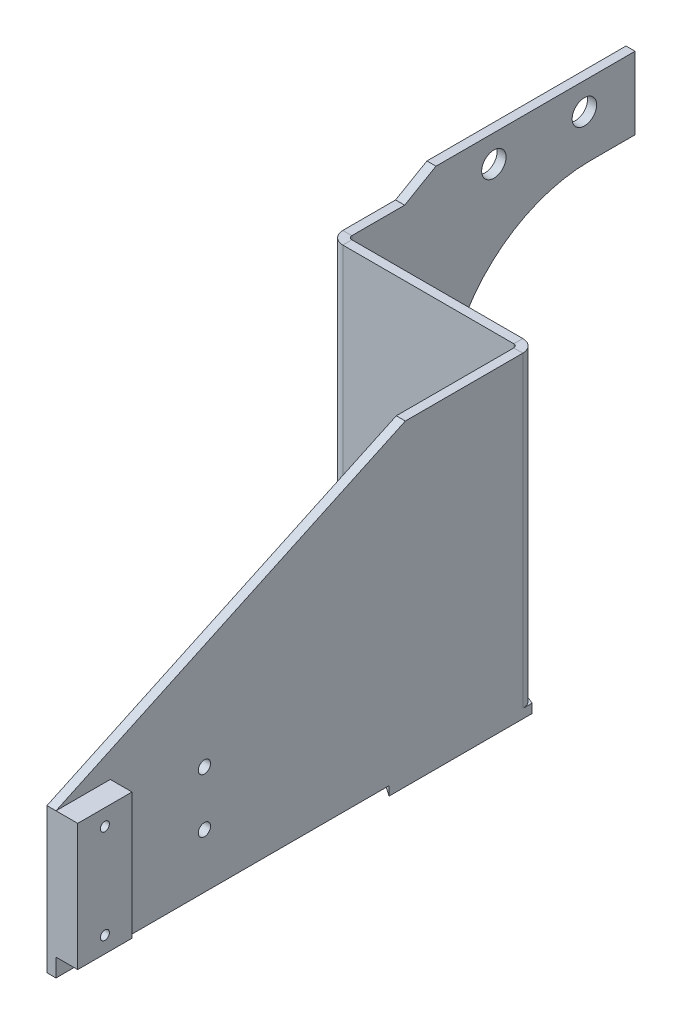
ISO-10303-21;
HEADER;
FILE_DESCRIPTION(('STEP AP214'),'2;1');
FILE_NAME('part.step','',(''),(''),'','','');
FILE_SCHEMA(('AUTOMOTIVE_DESIGN { 1 0 10303 214 1 1 1 1 }'));
ENDSEC;
DATA;
#1=APPLICATION_CONTEXT('core data for automotive mechanical design processes');
#2=APPLICATION_PROTOCOL_DEFINITION('international standard','automotive_design',2000,#1);
#3=PRODUCT_CONTEXT('',#1,'mechanical');
#4=PRODUCT('Part','Part','',(#3));
#5=PRODUCT_RELATED_PRODUCT_CATEGORY('part','',(#4));
#6=PRODUCT_DEFINITION_FORMATION('','',#4);
#7=PRODUCT_DEFINITION_CONTEXT('part definition',#1,'design');
#8=PRODUCT_DEFINITION('design','',#6,#7);
#9=PRODUCT_DEFINITION_SHAPE('','',#8);
#10=(LENGTH_UNIT() NAMED_UNIT(*) SI_UNIT(.MILLI.,.METRE.));
#11=(NAMED_UNIT(*) PLANE_ANGLE_UNIT() SI_UNIT($,.RADIAN.));
#12=(NAMED_UNIT(*) SI_UNIT($,.STERADIAN.) SOLID_ANGLE_UNIT());
#13=UNCERTAINTY_MEASURE_WITH_UNIT(LENGTH_MEASURE(1.E-05),#10,'distance_accuracy_value','');
#14=(GEOMETRIC_REPRESENTATION_CONTEXT(3) GLOBAL_UNCERTAINTY_ASSIGNED_CONTEXT((#13)) GLOBAL_UNIT_ASSIGNED_CONTEXT((#10,
#11,#12)) REPRESENTATION_CONTEXT('',''));
#15=CARTESIAN_POINT('',(0.,0.,0.));
#16=DIRECTION('',(0.,0.,1.));
#17=DIRECTION('',(1.,0.,0.));
#18=AXIS2_PLACEMENT_3D('',#15,#16,#17);
#19=CARTESIAN_POINT('',(-5.,-85.,523.));
#20=DIRECTION('',(0.,-1.,0.));
#21=DIRECTION('',(0.,0.,-1.));
#22=AXIS2_PLACEMENT_3D('',#19,#20,#21);
#23=PLANE('',#22);
#24=DIRECTION('',(0.,0.,-1.));
#25=VECTOR('',#24,1.);
#26=CARTESIAN_POINT('',(0.,-85.,523.));
#27=LINE('',#26,#25);
#28=CARTESIAN_POINT('',(0.,-85.,118.520131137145));
#29=VERTEX_POINT('',#28);
#30=CARTESIAN_POINT('',(0.,-85.,116.5));
#31=VERTEX_POINT('',#30);
#32=EDGE_CURVE('E407',#29,#31,#27,.T.);
#33=ORIENTED_EDGE('',*,*,#32,.F.);
#34=DIRECTION('',(0.927183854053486,0.,0.374606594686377));
#35=VECTOR('',#34,1.);
#36=CARTESIAN_POINT('',(-5.,-85.,116.5));
#37=LINE('',#36,#35);
#38=CARTESIAN_POINT('',(-5.,-85.,116.5));
#39=VERTEX_POINT('',#38);
#40=EDGE_CURVE('E229',#39,#29,#37,.T.);
#41=ORIENTED_EDGE('',*,*,#40,.F.);
#42=DIRECTION('',(1.,0.,0.));
#43=VECTOR('',#42,1.);
#44=CARTESIAN_POINT('',(-5.,-85.,116.5));
#45=LINE('',#44,#43);
#46=EDGE_CURVE('E395',#39,#31,#45,.T.);
#47=ORIENTED_EDGE('',*,*,#46,.T.);
#48=EDGE_LOOP('',(#33,#41,#47));
#49=FACE_BOUND('',#48,.T.);
#50=ADVANCED_FACE('F16',(#49),#23,.T.);
#51=CARTESIAN_POINT('',(98.4657082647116,-85.,423.397124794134));
#52=DIRECTION('',(0.,-1.,0.));
#53=DIRECTION('',(0.,0.,-1.));
#54=AXIS2_PLACEMENT_3D('',#51,#52,#53);
#55=PLANE('',#54);
#56=DIRECTION('',(0.,0.,-1.));
#57=VECTOR('',#56,1.);
#58=CARTESIAN_POINT('',(98.4657082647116,-85.,423.397124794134));
#59=LINE('',#58,#57);
#60=CARTESIAN_POINT('',(98.4657082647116,-85.,423.397124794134));
#61=VERTEX_POINT('',#60);
#62=CARTESIAN_POINT('',(98.4657082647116,-85.,235.91317736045));
#63=VERTEX_POINT('',#62);
#64=EDGE_CURVE('E340',#61,#63,#59,.T.);
#65=ORIENTED_EDGE('',*,*,#64,.T.);
#66=DIRECTION('',(-0.819152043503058,0.,-0.573576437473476));
#67=VECTOR('',#66,1.);
#68=CARTESIAN_POINT('',(103.465708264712,-85.,239.414215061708));
#69=LINE('',#68,#67);
#70=CARTESIAN_POINT('',(103.465708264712,-85.,239.414215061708));
#71=VERTEX_POINT('',#70);
#72=EDGE_CURVE('E549',#71,#63,#69,.T.);
#73=ORIENTED_EDGE('',*,*,#72,.F.);
#74=DIRECTION('',(0.,0.,-1.));
#75=VECTOR('',#74,1.);
#76=CARTESIAN_POINT('',(103.465708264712,-85.,423.397124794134));
#77=LINE('',#76,#75);
#78=CARTESIAN_POINT('',(103.465708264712,-85.,423.397124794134));
#79=VERTEX_POINT('',#78);
#80=EDGE_CURVE('E235',#79,#71,#77,.T.);
#81=ORIENTED_EDGE('',*,*,#80,.F.);
#82=DIRECTION('',(1.,0.,0.));
#83=VECTOR('',#82,1.);
#84=CARTESIAN_POINT('',(98.4657082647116,-85.,423.397124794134));
#85=LINE('',#84,#83);
#86=EDGE_CURVE('E352',#61,#79,#85,.T.);
#87=ORIENTED_EDGE('',*,*,#86,.F.);
#88=EDGE_LOOP('',(#65,#73,#81,#87));
#89=FACE_BOUND('',#88,.T.);
#90=ADVANCED_FACE('F596',(#89),#55,.T.);
#91=CARTESIAN_POINT('',(103.465708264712,-85.,423.397124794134));
#92=DIRECTION('',(1.,0.,0.));
#93=DIRECTION('',(0.,0.,-1.));
#94=AXIS2_PLACEMENT_3D('',#91,#92,#93);
#95=PLANE('',#94);
#96=CARTESIAN_POINT('',(103.465708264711,-25.,341.397124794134));
#97=DIRECTION('',(1.,0.,0.));
#98=DIRECTION('',(0.,0.,-1.));
#99=AXIS2_PLACEMENT_3D('',#96,#97,#98);
#100=CIRCLE('',#99,3.4);
#101=CARTESIAN_POINT('',(103.465708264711,-25.,337.997124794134));
#102=VERTEX_POINT('',#101);
#103=EDGE_CURVE('E297',#102,#102,#100,.T.);
#104=ORIENTED_EDGE('',*,*,#103,.F.);
#105=EDGE_LOOP('',(#104));
#106=FACE_BOUND('',#105,.T.);
#107=CARTESIAN_POINT('',(103.465708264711,-55.,341.397124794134));
#108=DIRECTION('',(1.,0.,0.));
#109=DIRECTION('',(0.,0.,-1.));
#110=AXIS2_PLACEMENT_3D('',#107,#108,#109);
#111=CIRCLE('',#110,3.4);
#112=CARTESIAN_POINT('',(103.465708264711,-55.,337.997124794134));
#113=VERTEX_POINT('',#112);
#114=EDGE_CURVE('E289',#113,#113,#111,.T.);
#115=ORIENTED_EDGE('',*,*,#114,.F.);
#116=EDGE_LOOP('',(#115));
#117=FACE_BOUND('',#116,.T.);
#118=DIRECTION('',(0.,1.,0.));
#119=VECTOR('',#118,1.);
#120=CARTESIAN_POINT('',(103.465708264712,-5.,393.397124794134));
#121=LINE('',#120,#119);
#122=CARTESIAN_POINT('',(103.465708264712,-75.,393.397124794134));
#123=VERTEX_POINT('',#122);
#124=CARTESIAN_POINT('',(103.465708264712,-5.,393.397124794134));
#125=VERTEX_POINT('',#124);
#126=EDGE_CURVE('E268',#123,#125,#121,.T.);
#127=ORIENTED_EDGE('',*,*,#126,.F.);
#128=DIRECTION('',(0.,0.,-1.));
#129=VECTOR('',#128,1.);
#130=CARTESIAN_POINT('',(103.465708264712,-75.,423.397124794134));
#131=LINE('',#130,#129);
#132=CARTESIAN_POINT('',(103.465708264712,-75.,423.397124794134));
#133=VERTEX_POINT('',#132);
#134=EDGE_CURVE('E251',#133,#123,#131,.T.);
#135=ORIENTED_EDGE('',*,*,#134,.F.);
#136=DIRECTION('',(0.,-1.,0.));
#137=VECTOR('',#136,1.);
#138=CARTESIAN_POINT('',(103.465708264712,95.,423.397124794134));
#139=LINE('',#138,#137);
#140=EDGE_CURVE('E331',#133,#79,#139,.T.);
#141=ORIENTED_EDGE('',*,*,#140,.T.);
#142=ORIENTED_EDGE('',*,*,#80,.T.);
#143=DIRECTION('',(0.,1.,0.));
#144=VECTOR('',#143,1.);
#145=CARTESIAN_POINT('',(103.465708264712,-90.,239.414215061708));
#146=LINE('',#145,#144);
#147=CARTESIAN_POINT('',(103.465708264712,-90.,239.414215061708));
#148=VERTEX_POINT('',#147);
#149=EDGE_CURVE('E37',#148,#71,#146,.T.);
#150=ORIENTED_EDGE('',*,*,#149,.F.);
#151=DIRECTION('',(0.,0.,1.));
#152=VECTOR('',#151,1.);
#153=CARTESIAN_POINT('',(103.465708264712,-90.,239.414215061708));
#154=LINE('',#153,#152);
#155=CARTESIAN_POINT('',(103.465708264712,-90.,160.322990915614));
#156=VERTEX_POINT('',#155);
#157=EDGE_CURVE('E219',#156,#148,#154,.T.);
#158=ORIENTED_EDGE('',*,*,#157,.F.);
#159=DIRECTION('',(0.,1.,0.));
#160=VECTOR('',#159,1.);
#161=CARTESIAN_POINT('',(103.465708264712,-90.,160.322990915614));
#162=LINE('',#161,#160);
#163=CARTESIAN_POINT('',(103.465708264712,-85.,160.322990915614));
#164=VERTEX_POINT('',#163);
#165=EDGE_CURVE('E536',#156,#164,#162,.T.);
#166=ORIENTED_EDGE('',*,*,#165,.T.);
#167=DIRECTION('',(0.,0.,1.));
#168=VECTOR('',#167,1.);
#169=CARTESIAN_POINT('',(103.465708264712,-85.,239.414215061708));
#170=LINE('',#169,#168);
#171=CARTESIAN_POINT('',(103.465708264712,-85.,165.465708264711));
#172=VERTEX_POINT('',#171);
#173=EDGE_CURVE('E544',#164,#172,#170,.T.);
#174=ORIENTED_EDGE('',*,*,#173,.T.);
#175=DIRECTION('',(0.,1.,0.));
#176=VECTOR('',#175,1.);
#177=CARTESIAN_POINT('',(103.465708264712,-85.,165.465708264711));
#178=LINE('',#177,#176);
#179=CARTESIAN_POINT('',(103.465708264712,85.,165.465708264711));
#180=VERTEX_POINT('',#179);
#181=EDGE_CURVE('E334',#172,#180,#178,.T.);
#182=ORIENTED_EDGE('',*,*,#181,.T.);
#183=DIRECTION('',(0.,0.,-1.));
#184=VECTOR('',#183,1.);
#185=CARTESIAN_POINT('',(103.465708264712,85.,27.7176328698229));
#186=LINE('',#185,#184);
#187=CARTESIAN_POINT('',(103.465708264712,85.,230.391501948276));
#188=VERTEX_POINT('',#187);
#189=EDGE_CURVE('E324',#188,#180,#186,.T.);
#190=ORIENTED_EDGE('',*,*,#189,.F.);
#191=DIRECTION('',(0.,0.422618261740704,-0.906307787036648));
#192=VECTOR('',#191,1.);
#193=CARTESIAN_POINT('',(103.465708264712,85.,230.391501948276));
#194=LINE('',#193,#192);
#195=CARTESIAN_POINT('',(103.465708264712,-5.,423.397124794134));
#196=VERTEX_POINT('',#195);
#197=EDGE_CURVE('E362',#196,#188,#194,.T.);
#198=ORIENTED_EDGE('',*,*,#197,.F.);
#199=DIRECTION('',(0.,0.,1.));
#200=VECTOR('',#199,1.);
#201=CARTESIAN_POINT('',(103.465708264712,-5.,423.397124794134));
#202=LINE('',#201,#200);
#203=EDGE_CURVE('E257',#125,#196,#202,.T.);
#204=ORIENTED_EDGE('',*,*,#203,.F.);
#205=EDGE_LOOP('',(#127,#135,#141,#142,#150,#158,#166,#174,#182,#190,#198,#204));
#206=FACE_BOUND('',#205,.T.);
#207=ADVANCED_FACE('F233',(#106,#117,#206),#95,.T.);
#208=CARTESIAN_POINT('',(-34.2137836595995,85.,163.465708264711));
#209=DIRECTION('',(0.,-1.,0.));
#210=DIRECTION('',(-1.,0.,0.));
#211=AXIS2_PLACEMENT_3D('',#208,#209,#210);
#212=PLANE('',#211);
#213=DIRECTION('',(-1.,0.,0.));
#214=VECTOR('',#213,1.);
#215=CARTESIAN_POINT('',(-34.2137836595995,85.,163.465708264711));
#216=LINE('',#215,#214);
#217=CARTESIAN_POINT('',(96.4657082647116,85.,163.465708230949));
#218=VERTEX_POINT('',#217);
#219=CARTESIAN_POINT('',(2.00000000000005,85.,163.465708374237));
#220=VERTEX_POINT('',#219);
#221=EDGE_CURVE('E20',#218,#220,#216,.T.);
#222=ORIENTED_EDGE('',*,*,#221,.F.);
#223=DIRECTION('',(0.,0.,-1.));
#224=VECTOR('',#223,1.);
#225=CARTESIAN_POINT('',(96.4657082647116,85.,163.465708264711));
#226=LINE('',#225,#224);
#227=CARTESIAN_POINT('',(96.4657082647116,85.,158.465708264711));
#228=VERTEX_POINT('',#227);
#229=EDGE_CURVE('E11',#218,#228,#226,.T.);
#230=ORIENTED_EDGE('',*,*,#229,.T.);
#231=DIRECTION('',(-1.,0.,0.));
#232=VECTOR('',#231,1.);
#233=CARTESIAN_POINT('',(-34.2137836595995,85.,158.465708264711));
#234=LINE('',#233,#232);
#235=CARTESIAN_POINT('',(2.,85.,158.465708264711));
#236=VERTEX_POINT('',#235);
#237=EDGE_CURVE('E398',#228,#236,#234,.T.);
#238=ORIENTED_EDGE('',*,*,#237,.T.);
#239=DIRECTION('',(0.,0.,-1.));
#240=VECTOR('',#239,1.);
#241=CARTESIAN_POINT('',(2.00000000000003,85.,163.465708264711));
#242=LINE('',#241,#240);
#243=EDGE_CURVE('E465',#220,#236,#242,.T.);
#244=ORIENTED_EDGE('',*,*,#243,.F.);
#245=EDGE_LOOP('',(#222,#230,#238,#244));
#246=FACE_BOUND('',#245,.T.);
#247=ADVANCED_FACE('F18',(#246),#212,.F.);
#248=CARTESIAN_POINT('',(361.465708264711,-85.,163.46570826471));
#249=DIRECTION('',(0.,0.,-1.));
#250=DIRECTION('',(-1.,0.,0.));
#251=AXIS2_PLACEMENT_3D('',#248,#249,#250);
#252=PLANE('',#251);
#253=DIRECTION('',(-1.,0.,0.));
#254=VECTOR('',#253,1.);
#255=CARTESIAN_POINT('',(361.465708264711,-85.,163.46570826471));
#256=LINE('',#255,#254);
#257=CARTESIAN_POINT('',(96.4657082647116,-85.,163.465708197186));
#258=VERTEX_POINT('',#257);
#259=CARTESIAN_POINT('',(2.,-85.,163.465708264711));
#260=VERTEX_POINT('',#259);
#261=EDGE_CURVE('E466',#258,#260,#256,.T.);
#262=ORIENTED_EDGE('',*,*,#261,.F.);
#263=DIRECTION('',(0.,1.,0.));
#264=VECTOR('',#263,1.);
#265=CARTESIAN_POINT('',(96.4657082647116,-85.,163.465708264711));
#266=LINE('',#265,#264);
#267=EDGE_CURVE('E472',#258,#218,#266,.T.);
#268=ORIENTED_EDGE('',*,*,#267,.T.);
#269=ORIENTED_EDGE('',*,*,#221,.T.);
#270=DIRECTION('',(0.,1.,0.));
#271=VECTOR('',#270,1.);
#272=CARTESIAN_POINT('',(2.00000000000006,-85.,163.465708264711));
#273=LINE('',#272,#271);
#274=EDGE_CURVE('E462',#260,#220,#273,.T.);
#275=ORIENTED_EDGE('',*,*,#274,.F.);
#276=EDGE_LOOP('',(#262,#268,#269,#275));
#277=FACE_BOUND('',#276,.T.);
#278=ADVANCED_FACE('F491',(#277),#252,.F.);
#279=CARTESIAN_POINT('',(361.465708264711,-85.,158.46570826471));
#280=DIRECTION('',(0.,0.,-1.));
#281=DIRECTION('',(-1.,0.,0.));
#282=AXIS2_PLACEMENT_3D('',#279,#280,#281);
#283=PLANE('',#282);
#284=DIRECTION('',(0.,1.,0.));
#285=VECTOR('',#284,1.);
#286=CARTESIAN_POINT('',(96.4657082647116,-85.,158.465708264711));
#287=LINE('',#286,#285);
#288=CARTESIAN_POINT('',(96.4657082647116,-85.,158.465708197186));
#289=VERTEX_POINT('',#288);
#290=EDGE_CURVE('E25',#289,#228,#287,.T.);
#291=ORIENTED_EDGE('',*,*,#290,.F.);
#292=DIRECTION('',(-1.,0.,0.));
#293=VECTOR('',#292,1.);
#294=CARTESIAN_POINT('',(361.465708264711,-85.,158.46570826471));
#295=LINE('',#294,#293);
#296=CARTESIAN_POINT('',(2.,-85.,158.465708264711));
#297=VERTEX_POINT('',#296);
#298=EDGE_CURVE('E479',#289,#297,#295,.T.);
#299=ORIENTED_EDGE('',*,*,#298,.T.);
#300=DIRECTION('',(0.,1.,0.));
#301=VECTOR('',#300,1.);
#302=CARTESIAN_POINT('',(2.00000000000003,-85.,158.465708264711));
#303=LINE('',#302,#301);
#304=EDGE_CURVE('E469',#297,#236,#303,.T.);
#305=ORIENTED_EDGE('',*,*,#304,.T.);
#306=ORIENTED_EDGE('',*,*,#237,.F.);
#307=EDGE_LOOP('',(#291,#299,#305,#306));
#308=FACE_BOUND('',#307,.T.);
#309=ADVANCED_FACE('F567',(#308),#283,.T.);
#310=CARTESIAN_POINT('',(-5.,-11.1081457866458,103.470872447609));
#311=DIRECTION('',(0.,0.173648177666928,0.984807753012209));
#312=DIRECTION('',(0.,-0.984807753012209,0.173648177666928));
#313=AXIS2_PLACEMENT_3D('',#310,#311,#312);
#314=PLANE('',#313);
#315=DIRECTION('',(0.,-0.984807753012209,0.173648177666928));
#316=VECTOR('',#315,1.);
#317=CARTESIAN_POINT('',(0.,-11.1081457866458,103.470872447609));
#318=LINE('',#317,#316);
#319=CARTESIAN_POINT('',(0.,-11.1081457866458,103.470872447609));
#320=VERTEX_POINT('',#319);
#321=EDGE_CURVE('E458',#320,#31,#318,.T.);
#322=ORIENTED_EDGE('',*,*,#321,.T.);
#323=ORIENTED_EDGE('',*,*,#46,.F.);
#324=DIRECTION('',(0.,-0.984807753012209,0.173648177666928));
#325=VECTOR('',#324,1.);
#326=CARTESIAN_POINT('',(-5.,-11.1081457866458,103.470872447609));
#327=LINE('',#326,#325);
#328=CARTESIAN_POINT('',(-5.,-11.1081457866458,103.470872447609));
#329=VERTEX_POINT('',#328);
#330=EDGE_CURVE('E413',#329,#39,#327,.T.);
#331=ORIENTED_EDGE('',*,*,#330,.F.);
#332=DIRECTION('',(1.,0.,0.));
#333=VECTOR('',#332,1.);
#334=CARTESIAN_POINT('',(-5.,-11.1081457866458,103.470872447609));
#335=LINE('',#334,#333);
#336=EDGE_CURVE('E456',#329,#320,#335,.T.);
#337=ORIENTED_EDGE('',*,*,#336,.T.);
#338=EDGE_LOOP('',(#322,#323,#331,#337));
#339=FACE_BOUND('',#338,.T.);
#340=ADVANCED_FACE('F531',(#339),#314,.F.);
#341=CARTESIAN_POINT('',(-5.,-25.,24.6862522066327));
#342=DIRECTION('',(1.,0.,0.));
#343=DIRECTION('',(0.,0.,-1.));
#344=AXIS2_PLACEMENT_3D('',#341,#342,#343);
#345=CYLINDRICAL_SURFACE('',#344,80.);
#346=CARTESIAN_POINT('',(0.,-25.,24.6862522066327));
#347=DIRECTION('',(1.,0.,0.));
#348=DIRECTION('',(0.,0.,1.));
#349=AXIS2_PLACEMENT_3D('',#346,#347,#348);
#350=CIRCLE('',#349,80.);
#351=CARTESIAN_POINT('',(0.,55.,24.6862522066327));
#352=VERTEX_POINT('',#351);
#353=EDGE_CURVE('E453',#352,#320,#350,.T.);
#354=ORIENTED_EDGE('',*,*,#353,.T.);
#355=ORIENTED_EDGE('',*,*,#336,.F.);
#356=CARTESIAN_POINT('',(-5.,-25.,24.6862522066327));
#357=DIRECTION('',(1.,0.,0.));
#358=DIRECTION('',(0.,0.,1.));
#359=AXIS2_PLACEMENT_3D('',#356,#357,#358);
#360=CIRCLE('',#359,80.);
#361=CARTESIAN_POINT('',(-5.,55.,24.6862522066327));
#362=VERTEX_POINT('',#361);
#363=EDGE_CURVE('E416',#362,#329,#360,.T.);
#364=ORIENTED_EDGE('',*,*,#363,.F.);
#365=DIRECTION('',(1.,0.,0.));
#366=VECTOR('',#365,1.);
#367=CARTESIAN_POINT('',(-5.,55.,24.6862522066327));
#368=LINE('',#367,#366);
#369=EDGE_CURVE('E451',#362,#352,#368,.T.);
#370=ORIENTED_EDGE('',*,*,#369,.T.);
#371=EDGE_LOOP('',(#354,#355,#364,#370));
#372=FACE_BOUND('',#371,.T.);
#373=ADVANCED_FACE('F526',(#372),#345,.F.);
#374=CARTESIAN_POINT('',(-5.,55.,0.));
#375=DIRECTION('',(0.,1.,0.));
#376=DIRECTION('',(0.,0.,1.));
#377=AXIS2_PLACEMENT_3D('',#374,#375,#376);
#378=PLANE('',#377);
#379=DIRECTION('',(0.,0.,1.));
#380=VECTOR('',#379,1.);
#381=CARTESIAN_POINT('',(0.,55.,0.));
#382=LINE('',#381,#380);
#383=CARTESIAN_POINT('',(0.,55.,0.));
#384=VERTEX_POINT('',#383);
#385=EDGE_CURVE('E448',#384,#352,#382,.T.);
#386=ORIENTED_EDGE('',*,*,#385,.T.);
#387=ORIENTED_EDGE('',*,*,#369,.F.);
#388=DIRECTION('',(0.,0.,1.));
#389=VECTOR('',#388,1.);
#390=CARTESIAN_POINT('',(-5.,55.,0.));
#391=LINE('',#390,#389);
#392=CARTESIAN_POINT('',(-5.,55.,0.));
#393=VERTEX_POINT('',#392);
#394=EDGE_CURVE('E419',#393,#362,#391,.T.);
#395=ORIENTED_EDGE('',*,*,#394,.F.);
#396=DIRECTION('',(1.,0.,0.));
#397=VECTOR('',#396,1.);
#398=CARTESIAN_POINT('',(-5.,55.,0.));
#399=LINE('',#398,#397);
#400=EDGE_CURVE('E446',#393,#384,#399,.T.);
#401=ORIENTED_EDGE('',*,*,#400,.T.);
#402=EDGE_LOOP('',(#386,#387,#395,#401));
#403=FACE_BOUND('',#402,.T.);
#404=ADVANCED_FACE('F522',(#403),#378,.F.);
#405=CARTESIAN_POINT('',(-5.,95.,0.));
#406=DIRECTION('',(0.,0.,-1.));
#407=DIRECTION('',(0.,1.,0.));
#408=AXIS2_PLACEMENT_3D('',#405,#406,#407);
#409=PLANE('',#408);
#410=ORIENTED_EDGE('',*,*,#400,.F.);
#411=DIRECTION('',(0.,1.,0.));
#412=VECTOR('',#411,1.);
#413=CARTESIAN_POINT('',(-5.,95.,0.));
#414=LINE('',#413,#412);
#415=CARTESIAN_POINT('',(-5.,95.,0.));
#416=VERTEX_POINT('',#415);
#417=EDGE_CURVE('E444',#393,#416,#414,.T.);
#418=ORIENTED_EDGE('',*,*,#417,.T.);
#419=DIRECTION('',(1.,0.,0.));
#420=VECTOR('',#419,1.);
#421=CARTESIAN_POINT('',(-5.,95.,0.));
#422=LINE('',#421,#420);
#423=CARTESIAN_POINT('',(0.,95.,0.));
#424=VERTEX_POINT('',#423);
#425=EDGE_CURVE('E441',#416,#424,#422,.T.);
#426=ORIENTED_EDGE('',*,*,#425,.T.);
#427=DIRECTION('',(0.,1.,0.));
#428=VECTOR('',#427,1.);
#429=CARTESIAN_POINT('',(0.,95.,0.));
#430=LINE('',#429,#428);
#431=EDGE_CURVE('E402',#384,#424,#430,.T.);
#432=ORIENTED_EDGE('',*,*,#431,.F.);
#433=EDGE_LOOP('',(#410,#418,#426,#432));
#434=FACE_BOUND('',#433,.T.);
#435=ADVANCED_FACE('F519',(#434),#409,.T.);
#436=CARTESIAN_POINT('',(-5.,95.,523.));
#437=DIRECTION('',(0.,1.,0.));
#438=DIRECTION('',(0.,0.,1.));
#439=AXIS2_PLACEMENT_3D('',#436,#437,#438);
#440=PLANE('',#439);
#441=DIRECTION('',(1.,0.,0.));
#442=VECTOR('',#441,1.);
#443=CARTESIAN_POINT('',(-5.,95.,110.));
#444=LINE('',#443,#442);
#445=CARTESIAN_POINT('',(-5.,95.,110.));
#446=VERTEX_POINT('',#445);
#447=CARTESIAN_POINT('',(0.,95.,110.));
#448=VERTEX_POINT('',#447);
#449=EDGE_CURVE('E438',#446,#448,#444,.T.);
#450=ORIENTED_EDGE('',*,*,#449,.T.);
#451=DIRECTION('',(0.,0.,1.));
#452=VECTOR('',#451,1.);
#453=CARTESIAN_POINT('',(0.,95.,523.));
#454=LINE('',#453,#452);
#455=EDGE_CURVE('E399',#424,#448,#454,.T.);
#456=ORIENTED_EDGE('',*,*,#455,.F.);
#457=ORIENTED_EDGE('',*,*,#425,.F.);
#458=DIRECTION('',(0.,0.,1.));
#459=VECTOR('',#458,1.);
#460=CARTESIAN_POINT('',(-5.,95.,523.));
#461=LINE('',#460,#459);
#462=EDGE_CURVE('E435',#416,#446,#461,.T.);
#463=ORIENTED_EDGE('',*,*,#462,.T.);
#464=EDGE_LOOP('',(#450,#456,#457,#463));
#465=FACE_BOUND('',#464,.T.);
#466=ADVANCED_FACE('F514',(#465),#440,.T.);
#467=CARTESIAN_POINT('',(-5.,95.,110.));
#468=DIRECTION('',(0.,-0.866025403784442,-0.5));
#469=DIRECTION('',(0.,0.5,-0.866025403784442));
#470=AXIS2_PLACEMENT_3D('',#467,#468,#469);
#471=PLANE('',#470);
#472=DIRECTION('',(0.,0.5,-0.866025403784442));
#473=VECTOR('',#472,1.);
#474=CARTESIAN_POINT('',(0.,95.,110.));
#475=LINE('',#474,#473);
#476=CARTESIAN_POINT('',(0.,85.,127.320508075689));
#477=VERTEX_POINT('',#476);
#478=EDGE_CURVE('E433',#477,#448,#475,.T.);
#479=ORIENTED_EDGE('',*,*,#478,.T.);
#480=ORIENTED_EDGE('',*,*,#449,.F.);
#481=DIRECTION('',(0.,0.5,-0.866025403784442));
#482=VECTOR('',#481,1.);
#483=CARTESIAN_POINT('',(-5.,95.,110.));
#484=LINE('',#483,#482);
#485=CARTESIAN_POINT('',(-5.,85.,127.320508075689));
#486=VERTEX_POINT('',#485);
#487=EDGE_CURVE('E422',#486,#446,#484,.T.);
#488=ORIENTED_EDGE('',*,*,#487,.F.);
#489=DIRECTION('',(1.,0.,0.));
#490=VECTOR('',#489,1.);
#491=CARTESIAN_POINT('',(-5.,85.,127.320508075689));
#492=LINE('',#491,#490);
#493=EDGE_CURVE('E430',#486,#477,#492,.T.);
#494=ORIENTED_EDGE('',*,*,#493,.T.);
#495=EDGE_LOOP('',(#479,#480,#488,#494));
#496=FACE_BOUND('',#495,.T.);
#497=ADVANCED_FACE('F509',(#496),#471,.F.);
#498=CARTESIAN_POINT('',(-5.,-85.,523.));
#499=DIRECTION('',(1.,0.,0.));
#500=DIRECTION('',(0.,0.,-1.));
#501=AXIS2_PLACEMENT_3D('',#498,#499,#500);
#502=PLANE('',#501);
#503=CARTESIAN_POINT('',(-5.00000005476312,80.,28.));
#504=DIRECTION('',(1.,0.,0.));
#505=DIRECTION('',(0.,0.,-1.));
#506=AXIS2_PLACEMENT_3D('',#503,#504,#505);
#507=CIRCLE('',#506,6.75);
#508=CARTESIAN_POINT('',(-5.00000005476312,80.,21.25));
#509=VERTEX_POINT('',#508);
#510=EDGE_CURVE('E305',#509,#509,#507,.T.);
#511=ORIENTED_EDGE('',*,*,#510,.T.);
#512=EDGE_LOOP('',(#511));
#513=FACE_BOUND('',#512,.T.);
#514=CARTESIAN_POINT('',(-5.00000005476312,80.,78.));
#515=DIRECTION('',(1.,0.,0.));
#516=DIRECTION('',(0.,0.,-1.));
#517=AXIS2_PLACEMENT_3D('',#514,#515,#516);
#518=CIRCLE('',#517,6.75);
#519=CARTESIAN_POINT('',(-5.00000005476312,80.,71.25));
#520=VERTEX_POINT('',#519);
#521=EDGE_CURVE('E311',#520,#520,#518,.T.);
#522=ORIENTED_EDGE('',*,*,#521,.T.);
#523=EDGE_LOOP('',(#522));
#524=FACE_BOUND('',#523,.T.);
#525=CARTESIAN_POINT('',(-5.00000005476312,-60.,128.));
#526=DIRECTION('',(1.,0.,0.));
#527=DIRECTION('',(0.,0.,-1.));
#528=AXIS2_PLACEMENT_3D('',#525,#526,#527);
#529=CIRCLE('',#528,6.75);
#530=CARTESIAN_POINT('',(-5.00000005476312,-60.,121.25));
#531=VERTEX_POINT('',#530);
#532=EDGE_CURVE('E317',#531,#531,#529,.T.);
#533=ORIENTED_EDGE('',*,*,#532,.T.);
#534=EDGE_LOOP('',(#533));
#535=FACE_BOUND('',#534,.T.);
#536=ORIENTED_EDGE('',*,*,#330,.T.);
#537=DIRECTION('',(0.,1.,0.));
#538=VECTOR('',#537,1.);
#539=CARTESIAN_POINT('',(-5.,-90.,116.5));
#540=LINE('',#539,#538);
#541=CARTESIAN_POINT('',(-5.,-90.,116.5));
#542=VERTEX_POINT('',#541);
#543=EDGE_CURVE('E244',#542,#39,#540,.T.);
#544=ORIENTED_EDGE('',*,*,#543,.F.);
#545=DIRECTION('',(1.37023613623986E-09,0.,-1.));
#546=VECTOR('',#545,1.);
#547=CARTESIAN_POINT('',(-5.00000006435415,-90.,163.465708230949));
#548=LINE('',#547,#546);
#549=CARTESIAN_POINT('',(-5.00000006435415,-90.,163.465708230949));
#550=VERTEX_POINT('',#549);
#551=EDGE_CURVE('E218',#550,#542,#548,.T.);
#552=ORIENTED_EDGE('',*,*,#551,.F.);
#553=DIRECTION('',(0.,1.,0.));
#554=VECTOR('',#553,1.);
#555=CARTESIAN_POINT('',(-5.00000006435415,-90.,163.465708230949));
#556=LINE('',#555,#554);
#557=CARTESIAN_POINT('',(-5.00000006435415,-85.,163.465708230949));
#558=VERTEX_POINT('',#557);
#559=EDGE_CURVE('E214',#550,#558,#556,.T.);
#560=ORIENTED_EDGE('',*,*,#559,.T.);
#561=DIRECTION('',(1.37023613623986E-09,0.,-1.));
#562=VECTOR('',#561,1.);
#563=CARTESIAN_POINT('',(-5.00000006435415,-85.,163.465708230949));
#564=LINE('',#563,#562);
#565=CARTESIAN_POINT('',(-5.0000000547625,-85.,156.46570825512));
#566=VERTEX_POINT('',#565);
#567=EDGE_CURVE('E502',#558,#566,#564,.T.);
#568=ORIENTED_EDGE('',*,*,#567,.T.);
#569=DIRECTION('',(0.,1.,0.));
#570=VECTOR('',#569,1.);
#571=CARTESIAN_POINT('',(-5.,-85.,156.465708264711));
#572=LINE('',#571,#570);
#573=CARTESIAN_POINT('',(-5.0000000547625,85.,156.465708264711));
#574=VERTEX_POINT('',#573);
#575=EDGE_CURVE('E427',#566,#574,#572,.T.);
#576=ORIENTED_EDGE('',*,*,#575,.T.);
#577=DIRECTION('',(0.,0.,-1.));
#578=VECTOR('',#577,1.);
#579=CARTESIAN_POINT('',(-5.,85.,127.320508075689));
#580=LINE('',#579,#578);
#581=EDGE_CURVE('E425',#574,#486,#580,.T.);
#582=ORIENTED_EDGE('',*,*,#581,.T.);
#583=ORIENTED_EDGE('',*,*,#487,.T.);
#584=ORIENTED_EDGE('',*,*,#462,.F.);
#585=ORIENTED_EDGE('',*,*,#417,.F.);
#586=ORIENTED_EDGE('',*,*,#394,.T.);
#587=ORIENTED_EDGE('',*,*,#363,.T.);
#588=EDGE_LOOP('',(#536,#544,#552,#560,#568,#576,#582,#583,#584,#585,#586,#587));
#589=FACE_BOUND('',#588,.T.);
#590=ADVANCED_FACE('F500',(#513,#524,#535,#589),#502,.F.);
#591=CARTESIAN_POINT('',(-5.,85.,127.320508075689));
#592=DIRECTION('',(0.,-1.,0.));
#593=DIRECTION('',(0.,0.,-1.));
#594=AXIS2_PLACEMENT_3D('',#591,#592,#593);
#595=PLANE('',#594);
#596=ORIENTED_EDGE('',*,*,#581,.F.);
#597=DIRECTION('',(1.,0.,0.));
#598=VECTOR('',#597,1.);
#599=CARTESIAN_POINT('',(-5.,85.,156.465708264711));
#600=LINE('',#599,#598);
#601=CARTESIAN_POINT('',(0.,85.,156.465708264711));
#602=VERTEX_POINT('',#601);
#603=EDGE_CURVE('E410',#574,#602,#600,.T.);
#604=ORIENTED_EDGE('',*,*,#603,.T.);
#605=DIRECTION('',(0.,0.,-1.));
#606=VECTOR('',#605,1.);
#607=CARTESIAN_POINT('',(0.,85.,127.320508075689));
#608=LINE('',#607,#606);
#609=EDGE_CURVE('E408',#602,#477,#608,.T.);
#610=ORIENTED_EDGE('',*,*,#609,.T.);
#611=ORIENTED_EDGE('',*,*,#493,.F.);
#612=EDGE_LOOP('',(#596,#604,#610,#611));
#613=FACE_BOUND('',#612,.T.);
#614=ADVANCED_FACE('F504',(#613),#595,.F.);
#615=CARTESIAN_POINT('',(0.,-85.,523.));
#616=DIRECTION('',(1.,0.,0.));
#617=DIRECTION('',(0.,0.,-1.));
#618=AXIS2_PLACEMENT_3D('',#615,#616,#617);
#619=PLANE('',#618);
#620=CARTESIAN_POINT('',(1.80368992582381E-12,80.,28.));
#621=DIRECTION('',(1.,0.,0.));
#622=DIRECTION('',(0.,0.,-1.));
#623=AXIS2_PLACEMENT_3D('',#620,#621,#622);
#624=CIRCLE('',#623,6.75);
#625=CARTESIAN_POINT('',(1.80368992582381E-12,80.,21.25));
#626=VERTEX_POINT('',#625);
#627=EDGE_CURVE('E308',#626,#626,#624,.T.);
#628=ORIENTED_EDGE('',*,*,#627,.F.);
#629=EDGE_LOOP('',(#628));
#630=FACE_BOUND('',#629,.T.);
#631=CARTESIAN_POINT('',(1.80368992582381E-12,80.,78.));
#632=DIRECTION('',(1.,0.,0.));
#633=DIRECTION('',(0.,0.,-1.));
#634=AXIS2_PLACEMENT_3D('',#631,#632,#633);
#635=CIRCLE('',#634,6.75);
#636=CARTESIAN_POINT('',(1.80368992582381E-12,80.,71.25));
#637=VERTEX_POINT('',#636);
#638=EDGE_CURVE('E314',#637,#637,#635,.T.);
#639=ORIENTED_EDGE('',*,*,#638,.F.);
#640=EDGE_LOOP('',(#639));
#641=FACE_BOUND('',#640,.T.);
#642=CARTESIAN_POINT('',(1.80368992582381E-12,-60.,128.));
#643=DIRECTION('',(1.,0.,0.));
#644=DIRECTION('',(0.,0.,-1.));
#645=AXIS2_PLACEMENT_3D('',#642,#643,#644);
#646=CIRCLE('',#645,6.75);
#647=CARTESIAN_POINT('',(1.80368992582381E-12,-60.,121.25));
#648=VERTEX_POINT('',#647);
#649=EDGE_CURVE('E320',#648,#648,#646,.T.);
#650=ORIENTED_EDGE('',*,*,#649,.F.);
#651=EDGE_LOOP('',(#650));
#652=FACE_BOUND('',#651,.T.);
#653=DIRECTION('',(0.,1.,0.));
#654=VECTOR('',#653,1.);
#655=CARTESIAN_POINT('',(0.,-85.,156.465708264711));
#656=LINE('',#655,#654);
#657=CARTESIAN_POINT('',(-1.09524908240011E-07,-85.,156.465708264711));
#658=VERTEX_POINT('',#657);
#659=EDGE_CURVE('E391',#658,#602,#656,.T.);
#660=ORIENTED_EDGE('',*,*,#659,.F.);
#661=EDGE_CURVE('E404',#658,#29,#27,.T.);
#662=ORIENTED_EDGE('',*,*,#661,.T.);
#663=ORIENTED_EDGE('',*,*,#32,.T.);
#664=ORIENTED_EDGE('',*,*,#321,.F.);
#665=ORIENTED_EDGE('',*,*,#353,.F.);
#666=ORIENTED_EDGE('',*,*,#385,.F.);
#667=ORIENTED_EDGE('',*,*,#431,.T.);
#668=ORIENTED_EDGE('',*,*,#455,.T.);
#669=ORIENTED_EDGE('',*,*,#478,.F.);
#670=ORIENTED_EDGE('',*,*,#609,.F.);
#671=EDGE_LOOP('',(#660,#662,#663,#664,#665,#666,#667,#668,#669,#670));
#672=FACE_BOUND('',#671,.T.);
#673=ADVANCED_FACE('F630',(#630,#641,#652,#672),#619,.T.);
#674=CARTESIAN_POINT('',(2.00000010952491,85.,156.465708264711));
#675=DIRECTION('',(0.,1.,0.));
#676=DIRECTION('',(0.,0.,1.));
#677=AXIS2_PLACEMENT_3D('',#674,#675,#676);
#678=PLANE('',#677);
#679=ORIENTED_EDGE('',*,*,#243,.T.);
#680=CARTESIAN_POINT('',(2.,85.,156.465708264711));
#681=DIRECTION('',(0.,1.,0.));
#682=DIRECTION('',(0.,0.,1.));
#683=AXIS2_PLACEMENT_3D('',#680,#681,#682);
#684=CIRCLE('',#683,2.00000010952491);
#685=EDGE_CURVE('E388',#236,#602,#684,.F.);
#686=ORIENTED_EDGE('',*,*,#685,.T.);
#687=ORIENTED_EDGE('',*,*,#603,.F.);
#688=CARTESIAN_POINT('',(2.00000010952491,85.,156.465708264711));
#689=DIRECTION('',(0.,-1.,0.));
#690=DIRECTION('',(0.,0.,-1.));
#691=AXIS2_PLACEMENT_3D('',#688,#689,#690);
#692=CIRCLE('',#691,7.0000001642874);
#693=EDGE_CURVE('E387',#220,#574,#692,.T.);
#694=ORIENTED_EDGE('',*,*,#693,.F.);
#695=EDGE_LOOP('',(#679,#686,#687,#694));
#696=FACE_BOUND('',#695,.T.);
#697=ADVANCED_FACE('F645',(#696),#678,.T.);
#698=CARTESIAN_POINT('',(2.,-170.22034212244,156.465708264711));
#699=DIRECTION('',(0.,1.,0.));
#700=DIRECTION('',(0.,0.,1.));
#701=AXIS2_PLACEMENT_3D('',#698,#699,#700);
#702=CYLINDRICAL_SURFACE('',#701,7.00000010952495);
#703=ORIENTED_EDGE('',*,*,#693,.T.);
#704=ORIENTED_EDGE('',*,*,#575,.F.);
#705=CARTESIAN_POINT('',(2.00000010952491,-85.,156.465708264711));
#706=DIRECTION('',(0.,1.,0.));
#707=DIRECTION('',(0.,0.,-1.));
#708=AXIS2_PLACEMENT_3D('',#705,#706,#707);
#709=CIRCLE('',#708,7.0000001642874);
#710=EDGE_CURVE('E384',#566,#260,#709,.T.);
#711=ORIENTED_EDGE('',*,*,#710,.T.);
#712=ORIENTED_EDGE('',*,*,#274,.T.);
#713=EDGE_LOOP('',(#703,#704,#711,#712));
#714=FACE_BOUND('',#713,.T.);
#715=ADVANCED_FACE('F497',(#714),#702,.T.);
#716=CARTESIAN_POINT('',(2.,-170.22034212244,156.465708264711));
#717=DIRECTION('',(0.,1.,0.));
#718=DIRECTION('',(0.,0.,1.));
#719=AXIS2_PLACEMENT_3D('',#716,#717,#718);
#720=CYLINDRICAL_SURFACE('',#719,2.00000010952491);
#721=ORIENTED_EDGE('',*,*,#685,.F.);
#722=ORIENTED_EDGE('',*,*,#304,.F.);
#723=CARTESIAN_POINT('',(2.,-85.,156.465708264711));
#724=DIRECTION('',(0.,1.,0.));
#725=DIRECTION('',(0.,0.,1.));
#726=AXIS2_PLACEMENT_3D('',#723,#724,#725);
#727=CIRCLE('',#726,2.00000010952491);
#728=EDGE_CURVE('E379',#658,#297,#727,.T.);
#729=ORIENTED_EDGE('',*,*,#728,.F.);
#730=ORIENTED_EDGE('',*,*,#659,.T.);
#731=EDGE_LOOP('',(#721,#722,#729,#730));
#732=FACE_BOUND('',#731,.T.);
#733=ADVANCED_FACE('F679',(#732),#720,.F.);
#734=CARTESIAN_POINT('',(96.4657082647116,85.,165.465708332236));
#735=DIRECTION('',(0.,-1.,0.));
#736=DIRECTION('',(0.,0.,-1.));
#737=AXIS2_PLACEMENT_3D('',#734,#735,#736);
#738=PLANE('',#737);
#739=DIRECTION('',(1.,0.,0.));
#740=VECTOR('',#739,1.);
#741=CARTESIAN_POINT('',(98.4657082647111,85.,165.465708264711));
#742=LINE('',#741,#740);
#743=CARTESIAN_POINT('',(98.4657083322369,85.,165.465708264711));
#744=VERTEX_POINT('',#743);
#745=EDGE_CURVE('E365',#744,#180,#742,.T.);
#746=ORIENTED_EDGE('',*,*,#745,.T.);
#747=CARTESIAN_POINT('',(96.4657082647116,85.,165.465708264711));
#748=DIRECTION('',(0.,1.,0.));
#749=DIRECTION('',(0.,0.,1.));
#750=AXIS2_PLACEMENT_3D('',#747,#748,#749);
#751=CIRCLE('',#750,7.00000006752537);
#752=EDGE_CURVE('E376',#180,#228,#751,.T.);
#753=ORIENTED_EDGE('',*,*,#752,.T.);
#754=ORIENTED_EDGE('',*,*,#229,.F.);
#755=CARTESIAN_POINT('',(96.4657082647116,85.,165.465708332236));
#756=DIRECTION('',(0.,1.,0.));
#757=DIRECTION('',(0.,0.,1.));
#758=AXIS2_PLACEMENT_3D('',#755,#756,#757);
#759=CIRCLE('',#758,2.00000010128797);
#760=EDGE_CURVE('E375',#744,#218,#759,.T.);
#761=ORIENTED_EDGE('',*,*,#760,.F.);
#762=EDGE_LOOP('',(#746,#753,#754,#761));
#763=FACE_BOUND('',#762,.T.);
#764=ADVANCED_FACE('F572',(#763),#738,.F.);
#765=CARTESIAN_POINT('',(96.4657082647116,-170.22034212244,165.465708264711));
#766=DIRECTION('',(0.,1.,0.));
#767=DIRECTION('',(0.,0.,1.));
#768=AXIS2_PLACEMENT_3D('',#765,#766,#767);
#769=CYLINDRICAL_SURFACE('',#768,2.00000006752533);
#770=ORIENTED_EDGE('',*,*,#760,.T.);
#771=ORIENTED_EDGE('',*,*,#267,.F.);
#772=CARTESIAN_POINT('',(96.4657082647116,-85.,165.465708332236));
#773=DIRECTION('',(0.,-1.,0.));
#774=DIRECTION('',(0.,0.,1.));
#775=AXIS2_PLACEMENT_3D('',#772,#773,#774);
#776=CIRCLE('',#775,2.00000010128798);
#777=CARTESIAN_POINT('',(98.4657082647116,-85.,165.465708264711));
#778=VERTEX_POINT('',#777);
#779=EDGE_CURVE('E371',#258,#778,#776,.T.);
#780=ORIENTED_EDGE('',*,*,#779,.T.);
#781=DIRECTION('',(0.,1.,0.));
#782=VECTOR('',#781,1.);
#783=CARTESIAN_POINT('',(98.4657082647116,-85.,165.465708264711));
#784=LINE('',#783,#782);
#785=EDGE_CURVE('E323',#778,#744,#784,.T.);
#786=ORIENTED_EDGE('',*,*,#785,.T.);
#787=EDGE_LOOP('',(#770,#771,#780,#786));
#788=FACE_BOUND('',#787,.T.);
#789=ADVANCED_FACE('F574',(#788),#769,.F.);
#790=CARTESIAN_POINT('',(96.4657082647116,-170.22034212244,165.465708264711));
#791=DIRECTION('',(0.,1.,0.));
#792=DIRECTION('',(0.,0.,1.));
#793=AXIS2_PLACEMENT_3D('',#790,#791,#792);
#794=CYLINDRICAL_SURFACE('',#793,7.00000006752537);
#795=ORIENTED_EDGE('',*,*,#752,.F.);
#796=ORIENTED_EDGE('',*,*,#181,.F.);
#797=CARTESIAN_POINT('',(96.4657082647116,-85.,165.465708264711));
#798=DIRECTION('',(0.,1.,0.));
#799=DIRECTION('',(0.,0.,1.));
#800=AXIS2_PLACEMENT_3D('',#797,#798,#799);
#801=CIRCLE('',#800,7.00000006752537);
#802=EDGE_CURVE('E327',#289,#172,#801,.F.);
#803=ORIENTED_EDGE('',*,*,#802,.F.);
#804=ORIENTED_EDGE('',*,*,#290,.T.);
#805=EDGE_LOOP('',(#795,#796,#803,#804));
#806=FACE_BOUND('',#805,.T.);
#807=ADVANCED_FACE('F564',(#806),#794,.T.);
#808=CARTESIAN_POINT('',(98.4657082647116,85.,230.391501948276));
#809=DIRECTION('',(0.,-0.906307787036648,-0.422618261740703));
#810=DIRECTION('',(0.,0.422618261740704,-0.906307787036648));
#811=AXIS2_PLACEMENT_3D('',#808,#809,#810);
#812=PLANE('',#811);
#813=ORIENTED_EDGE('',*,*,#197,.T.);
#814=DIRECTION('',(1.,0.,0.));
#815=VECTOR('',#814,1.);
#816=CARTESIAN_POINT('',(98.4657082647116,85.,230.391501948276));
#817=LINE('',#816,#815);
#818=CARTESIAN_POINT('',(98.4657082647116,85.,230.391501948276));
#819=VERTEX_POINT('',#818);
#820=EDGE_CURVE('E328',#819,#188,#817,.T.);
#821=ORIENTED_EDGE('',*,*,#820,.F.);
#822=DIRECTION('',(0.,0.422618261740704,-0.906307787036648));
#823=VECTOR('',#822,1.);
#824=CARTESIAN_POINT('',(98.4657082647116,85.,230.391501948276));
#825=LINE('',#824,#823);
#826=CARTESIAN_POINT('',(98.4657082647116,-5.,423.397124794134));
#827=VERTEX_POINT('',#826);
#828=EDGE_CURVE('E349',#827,#819,#825,.T.);
#829=ORIENTED_EDGE('',*,*,#828,.F.);
#830=DIRECTION('',(1.,0.,0.));
#831=VECTOR('',#830,1.);
#832=CARTESIAN_POINT('',(98.4657082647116,-5.,423.397124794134));
#833=LINE('',#832,#831);
#834=EDGE_CURVE('E359',#827,#196,#833,.T.);
#835=ORIENTED_EDGE('',*,*,#834,.T.);
#836=EDGE_LOOP('',(#813,#821,#829,#835));
#837=FACE_BOUND('',#836,.T.);
#838=ADVANCED_FACE('F588',(#837),#812,.F.);
#839=CARTESIAN_POINT('',(98.4657082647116,95.,423.397124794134));
#840=DIRECTION('',(0.,0.,1.));
#841=DIRECTION('',(1.,0.,0.));
#842=AXIS2_PLACEMENT_3D('',#839,#840,#841);
#843=PLANE('',#842);
#844=ORIENTED_EDGE('',*,*,#834,.F.);
#845=DIRECTION('',(0.,-1.,0.));
#846=VECTOR('',#845,1.);
#847=CARTESIAN_POINT('',(98.4657082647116,95.,423.397124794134));
#848=LINE('',#847,#846);
#849=EDGE_CURVE('E356',#827,#61,#848,.T.);
#850=ORIENTED_EDGE('',*,*,#849,.T.);
#851=ORIENTED_EDGE('',*,*,#86,.T.);
#852=ORIENTED_EDGE('',*,*,#140,.F.);
#853=DIRECTION('',(-1.,0.,0.));
#854=VECTOR('',#853,1.);
#855=CARTESIAN_POINT('',(115.465708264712,-75.,423.397124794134));
#856=LINE('',#855,#854);
#857=CARTESIAN_POINT('',(115.465708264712,-75.,423.397124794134));
#858=VERTEX_POINT('',#857);
#859=EDGE_CURVE('E279',#858,#133,#856,.T.);
#860=ORIENTED_EDGE('',*,*,#859,.F.);
#861=DIRECTION('',(0.,-1.,0.));
#862=VECTOR('',#861,1.);
#863=CARTESIAN_POINT('',(115.465708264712,-5.,423.397124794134));
#864=LINE('',#863,#862);
#865=CARTESIAN_POINT('',(115.465708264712,-5.,423.397124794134));
#866=VERTEX_POINT('',#865);
#867=EDGE_CURVE('E252',#866,#858,#864,.T.);
#868=ORIENTED_EDGE('',*,*,#867,.F.);
#869=DIRECTION('',(-1.,0.,0.));
#870=VECTOR('',#869,1.);
#871=CARTESIAN_POINT('',(115.465708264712,-5.,423.397124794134));
#872=LINE('',#871,#870);
#873=EDGE_CURVE('E265',#866,#196,#872,.T.);
#874=ORIENTED_EDGE('',*,*,#873,.T.);
#875=EDGE_LOOP('',(#844,#850,#851,#852,#860,#868,#874));
#876=FACE_BOUND('',#875,.T.);
#877=ADVANCED_FACE('F591',(#876),#843,.T.);
#878=CARTESIAN_POINT('',(98.4657082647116,-85.,423.397124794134));
#879=DIRECTION('',(1.,0.,0.));
#880=DIRECTION('',(0.,0.,-1.));
#881=AXIS2_PLACEMENT_3D('',#878,#879,#880);
#882=PLANE('',#881);
#883=CARTESIAN_POINT('',(98.4657082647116,-66.,408.397124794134));
#884=DIRECTION('',(1.,0.,0.));
#885=DIRECTION('',(0.,1.,0.));
#886=AXIS2_PLACEMENT_3D('',#883,#884,#885);
#887=CIRCLE('',#886,2.5);
#888=CARTESIAN_POINT('',(98.4657082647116,-63.5,408.397124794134));
#889=VERTEX_POINT('',#888);
#890=EDGE_CURVE('E282',#889,#889,#887,.T.);
#891=ORIENTED_EDGE('',*,*,#890,.T.);
#892=EDGE_LOOP('',(#891));
#893=FACE_BOUND('',#892,.T.);
#894=CARTESIAN_POINT('',(98.4657082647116,-14.,408.397124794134));
#895=DIRECTION('',(1.,0.,0.));
#896=DIRECTION('',(0.,1.,0.));
#897=AXIS2_PLACEMENT_3D('',#894,#895,#896);
#898=CIRCLE('',#897,2.5);
#899=CARTESIAN_POINT('',(98.4657082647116,-11.5,408.397124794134));
#900=VERTEX_POINT('',#899);
#901=EDGE_CURVE('E286',#900,#900,#898,.T.);
#902=ORIENTED_EDGE('',*,*,#901,.T.);
#903=EDGE_LOOP('',(#902));
#904=FACE_BOUND('',#903,.T.);
#905=CARTESIAN_POINT('',(98.4657082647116,-55.,341.397124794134));
#906=DIRECTION('',(1.,0.,0.));
#907=DIRECTION('',(0.,1.,0.));
#908=AXIS2_PLACEMENT_3D('',#905,#906,#907);
#909=CIRCLE('',#908,3.4);
#910=CARTESIAN_POINT('',(98.4657082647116,-51.6,341.397124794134));
#911=VERTEX_POINT('',#910);
#912=EDGE_CURVE('E293',#911,#911,#909,.T.);
#913=ORIENTED_EDGE('',*,*,#912,.T.);
#914=EDGE_LOOP('',(#913));
#915=FACE_BOUND('',#914,.T.);
#916=CARTESIAN_POINT('',(98.4657082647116,-25.,341.397124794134));
#917=DIRECTION('',(1.,0.,0.));
#918=DIRECTION('',(0.,1.,0.));
#919=AXIS2_PLACEMENT_3D('',#916,#917,#918);
#920=CIRCLE('',#919,3.4);
#921=CARTESIAN_POINT('',(98.4657082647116,-21.6,341.397124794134));
#922=VERTEX_POINT('',#921);
#923=EDGE_CURVE('E301',#922,#922,#920,.T.);
#924=ORIENTED_EDGE('',*,*,#923,.T.);
#925=EDGE_LOOP('',(#924));
#926=FACE_BOUND('',#925,.T.);
#927=ORIENTED_EDGE('',*,*,#785,.F.);
#928=EDGE_CURVE('E344',#63,#778,#59,.T.);
#929=ORIENTED_EDGE('',*,*,#928,.F.);
#930=ORIENTED_EDGE('',*,*,#64,.F.);
#931=ORIENTED_EDGE('',*,*,#849,.F.);
#932=ORIENTED_EDGE('',*,*,#828,.T.);
#933=DIRECTION('',(0.,0.,-1.));
#934=VECTOR('',#933,1.);
#935=CARTESIAN_POINT('',(98.4657082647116,85.,27.7176328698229));
#936=LINE('',#935,#934);
#937=EDGE_CURVE('E345',#819,#744,#936,.T.);
#938=ORIENTED_EDGE('',*,*,#937,.T.);
#939=EDGE_LOOP('',(#927,#929,#930,#931,#932,#938));
#940=FACE_BOUND('',#939,.T.);
#941=ADVANCED_FACE('F578',(#893,#904,#915,#926,#940),#882,.F.);
#942=CARTESIAN_POINT('',(98.4657082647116,85.,27.7176328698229));
#943=DIRECTION('',(0.,-1.,0.));
#944=DIRECTION('',(0.,0.,-1.));
#945=AXIS2_PLACEMENT_3D('',#942,#943,#944);
#946=PLANE('',#945);
#947=ORIENTED_EDGE('',*,*,#745,.F.);
#948=ORIENTED_EDGE('',*,*,#937,.F.);
#949=ORIENTED_EDGE('',*,*,#820,.T.);
#950=ORIENTED_EDGE('',*,*,#189,.T.);
#951=EDGE_LOOP('',(#947,#948,#949,#950));
#952=FACE_BOUND('',#951,.T.);
#953=ADVANCED_FACE('F583',(#952),#946,.F.);
#954=CARTESIAN_POINT('',(1.80411241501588E-12,-60.,128.));
#955=DIRECTION('',(1.,0.,0.));
#956=DIRECTION('',(0.,0.,-1.));
#957=AXIS2_PLACEMENT_3D('',#954,#955,#956);
#958=CYLINDRICAL_SURFACE('',#957,6.75);
#959=ORIENTED_EDGE('',*,*,#532,.F.);
#960=EDGE_LOOP('',(#959));
#961=FACE_BOUND('',#960,.T.);
#962=ORIENTED_EDGE('',*,*,#649,.T.);
#963=EDGE_LOOP('',(#962));
#964=FACE_BOUND('',#963,.T.);
#965=ADVANCED_FACE('F695',(#961,#964),#958,.F.);
#966=CARTESIAN_POINT('',(1.80411241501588E-12,80.,78.));
#967=DIRECTION('',(1.,0.,0.));
#968=DIRECTION('',(0.,0.,-1.));
#969=AXIS2_PLACEMENT_3D('',#966,#967,#968);
#970=CYLINDRICAL_SURFACE('',#969,6.75);
#971=ORIENTED_EDGE('',*,*,#521,.F.);
#972=EDGE_LOOP('',(#971));
#973=FACE_BOUND('',#972,.T.);
#974=ORIENTED_EDGE('',*,*,#638,.T.);
#975=EDGE_LOOP('',(#974));
#976=FACE_BOUND('',#975,.T.);
#977=ADVANCED_FACE('F708',(#973,#976),#970,.F.);
#978=CARTESIAN_POINT('',(1.80411241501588E-12,80.,28.));
#979=DIRECTION('',(1.,0.,0.));
#980=DIRECTION('',(0.,0.,-1.));
#981=AXIS2_PLACEMENT_3D('',#978,#979,#980);
#982=CYLINDRICAL_SURFACE('',#981,6.75);
#983=ORIENTED_EDGE('',*,*,#510,.F.);
#984=EDGE_LOOP('',(#983));
#985=FACE_BOUND('',#984,.T.);
#986=ORIENTED_EDGE('',*,*,#627,.T.);
#987=EDGE_LOOP('',(#986));
#988=FACE_BOUND('',#987,.T.);
#989=ADVANCED_FACE('F712',(#985,#988),#982,.F.);
#990=CARTESIAN_POINT('',(103.465708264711,-25.,341.397124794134));
#991=DIRECTION('',(1.,0.,0.));
#992=DIRECTION('',(0.,0.,-1.));
#993=AXIS2_PLACEMENT_3D('',#990,#991,#992);
#994=CYLINDRICAL_SURFACE('',#993,3.4);
#995=ORIENTED_EDGE('',*,*,#103,.T.);
#996=EDGE_LOOP('',(#995));
#997=FACE_BOUND('',#996,.T.);
#998=ORIENTED_EDGE('',*,*,#923,.F.);
#999=EDGE_LOOP('',(#998));
#1000=FACE_BOUND('',#999,.T.);
#1001=ADVANCED_FACE('F716',(#997,#1000),#994,.F.);
#1002=CARTESIAN_POINT('',(103.465708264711,-55.,341.397124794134));
#1003=DIRECTION('',(1.,0.,0.));
#1004=DIRECTION('',(0.,0.,-1.));
#1005=AXIS2_PLACEMENT_3D('',#1002,#1003,#1004);
#1006=CYLINDRICAL_SURFACE('',#1005,3.4);
#1007=ORIENTED_EDGE('',*,*,#114,.T.);
#1008=EDGE_LOOP('',(#1007));
#1009=FACE_BOUND('',#1008,.T.);
#1010=ORIENTED_EDGE('',*,*,#912,.F.);
#1011=EDGE_LOOP('',(#1010));
#1012=FACE_BOUND('',#1011,.T.);
#1013=ADVANCED_FACE('F720',(#1009,#1012),#1006,.F.);
#1014=CARTESIAN_POINT('',(103.465708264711,-14.,408.397124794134));
#1015=DIRECTION('',(1.,0.,0.));
#1016=DIRECTION('',(0.,0.,-1.));
#1017=AXIS2_PLACEMENT_3D('',#1014,#1015,#1016);
#1018=CYLINDRICAL_SURFACE('',#1017,2.5);
#1019=ORIENTED_EDGE('',*,*,#901,.F.);
#1020=EDGE_LOOP('',(#1019));
#1021=FACE_BOUND('',#1020,.T.);
#1022=CARTESIAN_POINT('',(115.465708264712,-14.,408.397124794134));
#1023=DIRECTION('',(1.,0.,0.));
#1024=DIRECTION('',(0.,0.,-1.));
#1025=AXIS2_PLACEMENT_3D('',#1022,#1023,#1024);
#1026=CIRCLE('',#1025,2.5);
#1027=CARTESIAN_POINT('',(115.465708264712,-14.,405.897124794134));
#1028=VERTEX_POINT('',#1027);
#1029=EDGE_CURVE('E237',#1028,#1028,#1026,.T.);
#1030=ORIENTED_EDGE('',*,*,#1029,.T.);
#1031=EDGE_LOOP('',(#1030));
#1032=FACE_BOUND('',#1031,.T.);
#1033=ADVANCED_FACE('F724',(#1021,#1032),#1018,.F.);
#1034=CARTESIAN_POINT('',(103.465708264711,-66.,408.397124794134));
#1035=DIRECTION('',(1.,0.,0.));
#1036=DIRECTION('',(0.,0.,-1.));
#1037=AXIS2_PLACEMENT_3D('',#1034,#1035,#1036);
#1038=CYLINDRICAL_SURFACE('',#1037,2.5);
#1039=ORIENTED_EDGE('',*,*,#890,.F.);
#1040=EDGE_LOOP('',(#1039));
#1041=FACE_BOUND('',#1040,.T.);
#1042=CARTESIAN_POINT('',(115.465708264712,-66.,408.397124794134));
#1043=DIRECTION('',(1.,0.,0.));
#1044=DIRECTION('',(0.,0.,-1.));
#1045=AXIS2_PLACEMENT_3D('',#1042,#1043,#1044);
#1046=CIRCLE('',#1045,2.5);
#1047=CARTESIAN_POINT('',(115.465708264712,-66.,405.897124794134));
#1048=VERTEX_POINT('',#1047);
#1049=EDGE_CURVE('E242',#1048,#1048,#1046,.T.);
#1050=ORIENTED_EDGE('',*,*,#1049,.T.);
#1051=EDGE_LOOP('',(#1050));
#1052=FACE_BOUND('',#1051,.T.);
#1053=ADVANCED_FACE('F728',(#1041,#1052),#1038,.F.);
#1054=CARTESIAN_POINT('',(115.465708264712,-75.,423.397124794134));
#1055=DIRECTION('',(0.,1.,0.));
#1056=DIRECTION('',(-1.,0.,0.));
#1057=AXIS2_PLACEMENT_3D('',#1054,#1055,#1056);
#1058=PLANE('',#1057);
#1059=ORIENTED_EDGE('',*,*,#134,.T.);
#1060=DIRECTION('',(-1.,0.,0.));
#1061=VECTOR('',#1060,1.);
#1062=CARTESIAN_POINT('',(115.465708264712,-75.,393.397124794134));
#1063=LINE('',#1062,#1061);
#1064=CARTESIAN_POINT('',(115.465708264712,-75.,393.397124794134));
#1065=VERTEX_POINT('',#1064);
#1066=EDGE_CURVE('E275',#1065,#123,#1063,.T.);
#1067=ORIENTED_EDGE('',*,*,#1066,.F.);
#1068=DIRECTION('',(0.,0.,-1.));
#1069=VECTOR('',#1068,1.);
#1070=CARTESIAN_POINT('',(115.465708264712,-75.,423.397124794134));
#1071=LINE('',#1070,#1069);
#1072=EDGE_CURVE('E256',#858,#1065,#1071,.T.);
#1073=ORIENTED_EDGE('',*,*,#1072,.F.);
#1074=ORIENTED_EDGE('',*,*,#859,.T.);
#1075=EDGE_LOOP('',(#1059,#1067,#1073,#1074));
#1076=FACE_BOUND('',#1075,.T.);
#1077=ADVANCED_FACE('F602',(#1076),#1058,.F.);
#1078=CARTESIAN_POINT('',(115.465708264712,-5.,393.397124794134));
#1079=DIRECTION('',(0.,0.,1.));
#1080=DIRECTION('',(1.,0.,0.));
#1081=AXIS2_PLACEMENT_3D('',#1078,#1079,#1080);
#1082=PLANE('',#1081);
#1083=ORIENTED_EDGE('',*,*,#126,.T.);
#1084=DIRECTION('',(-1.,0.,0.));
#1085=VECTOR('',#1084,1.);
#1086=CARTESIAN_POINT('',(115.465708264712,-5.,393.397124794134));
#1087=LINE('',#1086,#1085);
#1088=CARTESIAN_POINT('',(115.465708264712,-5.,393.397124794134));
#1089=VERTEX_POINT('',#1088);
#1090=EDGE_CURVE('E45',#1089,#125,#1087,.T.);
#1091=ORIENTED_EDGE('',*,*,#1090,.F.);
#1092=DIRECTION('',(0.,1.,0.));
#1093=VECTOR('',#1092,1.);
#1094=CARTESIAN_POINT('',(115.465708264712,-5.,393.397124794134));
#1095=LINE('',#1094,#1093);
#1096=EDGE_CURVE('E260',#1065,#1089,#1095,.T.);
#1097=ORIENTED_EDGE('',*,*,#1096,.F.);
#1098=ORIENTED_EDGE('',*,*,#1066,.T.);
#1099=EDGE_LOOP('',(#1083,#1091,#1097,#1098));
#1100=FACE_BOUND('',#1099,.T.);
#1101=ADVANCED_FACE('F605',(#1100),#1082,.F.);
#1102=CARTESIAN_POINT('',(115.465708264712,-5.,423.397124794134));
#1103=DIRECTION('',(0.,-1.,0.));
#1104=DIRECTION('',(1.,0.,0.));
#1105=AXIS2_PLACEMENT_3D('',#1102,#1103,#1104);
#1106=PLANE('',#1105);
#1107=ORIENTED_EDGE('',*,*,#203,.T.);
#1108=ORIENTED_EDGE('',*,*,#873,.F.);
#1109=DIRECTION('',(0.,0.,1.));
#1110=VECTOR('',#1109,1.);
#1111=CARTESIAN_POINT('',(115.465708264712,-5.,423.397124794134));
#1112=LINE('',#1111,#1110);
#1113=EDGE_CURVE('E263',#1089,#866,#1112,.T.);
#1114=ORIENTED_EDGE('',*,*,#1113,.F.);
#1115=ORIENTED_EDGE('',*,*,#1090,.T.);
#1116=EDGE_LOOP('',(#1107,#1108,#1114,#1115));
#1117=FACE_BOUND('',#1116,.T.);
#1118=ADVANCED_FACE('F608',(#1117),#1106,.F.);
#1119=CARTESIAN_POINT('',(115.465708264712,-75.,423.397124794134));
#1120=DIRECTION('',(1.,0.,0.));
#1121=DIRECTION('',(0.,0.,-1.));
#1122=AXIS2_PLACEMENT_3D('',#1119,#1120,#1121);
#1123=PLANE('',#1122);
#1124=ORIENTED_EDGE('',*,*,#1029,.F.);
#1125=EDGE_LOOP('',(#1124));
#1126=FACE_BOUND('',#1125,.T.);
#1127=ORIENTED_EDGE('',*,*,#1049,.F.);
#1128=EDGE_LOOP('',(#1127));
#1129=FACE_BOUND('',#1128,.T.);
#1130=ORIENTED_EDGE('',*,*,#867,.T.);
#1131=ORIENTED_EDGE('',*,*,#1072,.T.);
#1132=ORIENTED_EDGE('',*,*,#1096,.T.);
#1133=ORIENTED_EDGE('',*,*,#1113,.T.);
#1134=EDGE_LOOP('',(#1130,#1131,#1132,#1133));
#1135=FACE_BOUND('',#1134,.T.);
#1136=ADVANCED_FACE('F607',(#1126,#1129,#1135),#1123,.T.);
#1137=CARTESIAN_POINT('',(103.465708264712,-85.,160.322990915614));
#1138=DIRECTION('',(0.,-1.,0.));
#1139=DIRECTION('',(0.,0.,-1.));
#1140=AXIS2_PLACEMENT_3D('',#1137,#1138,#1139);
#1141=PLANE('',#1140);
#1142=ORIENTED_EDGE('',*,*,#661,.F.);
#1143=ORIENTED_EDGE('',*,*,#728,.T.);
#1144=ORIENTED_EDGE('',*,*,#298,.F.);
#1145=ORIENTED_EDGE('',*,*,#802,.T.);
#1146=ORIENTED_EDGE('',*,*,#173,.F.);
#1147=EDGE_CURVE('E553',#29,#164,#37,.T.);
#1148=ORIENTED_EDGE('',*,*,#1147,.F.);
#1149=EDGE_LOOP('',(#1142,#1143,#1144,#1145,#1146,#1148));
#1150=FACE_BOUND('',#1149,.T.);
#1151=ADVANCED_FACE('F559',(#1150),#1141,.F.);
#1152=CARTESIAN_POINT('',(103.465708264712,-90.,239.414215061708));
#1153=DIRECTION('',(0.573576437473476,0.,-0.819152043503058));
#1154=DIRECTION('',(-0.819152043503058,0.,-0.573576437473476));
#1155=AXIS2_PLACEMENT_3D('',#1152,#1153,#1154);
#1156=PLANE('',#1155);
#1157=ORIENTED_EDGE('',*,*,#72,.T.);
#1158=EDGE_CURVE('E548',#63,#558,#69,.T.);
#1159=ORIENTED_EDGE('',*,*,#1158,.T.);
#1160=ORIENTED_EDGE('',*,*,#559,.F.);
#1161=DIRECTION('',(-0.819152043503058,0.,-0.573576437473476));
#1162=VECTOR('',#1161,1.);
#1163=CARTESIAN_POINT('',(103.465708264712,-90.,239.414215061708));
#1164=LINE('',#1163,#1162);
#1165=EDGE_CURVE('E210',#148,#550,#1164,.T.);
#1166=ORIENTED_EDGE('',*,*,#1165,.F.);
#1167=ORIENTED_EDGE('',*,*,#149,.T.);
#1168=EDGE_LOOP('',(#1157,#1159,#1160,#1166,#1167));
#1169=FACE_BOUND('',#1168,.T.);
#1170=ADVANCED_FACE('F212',(#1169),#1156,.F.);
#1171=CARTESIAN_POINT('',(-5.,-90.,116.5));
#1172=DIRECTION('',(-0.374606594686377,0.,0.927183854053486));
#1173=DIRECTION('',(0.927183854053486,0.,0.374606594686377));
#1174=AXIS2_PLACEMENT_3D('',#1171,#1172,#1173);
#1175=PLANE('',#1174);
#1176=ORIENTED_EDGE('',*,*,#40,.T.);
#1177=ORIENTED_EDGE('',*,*,#1147,.T.);
#1178=ORIENTED_EDGE('',*,*,#165,.F.);
#1179=DIRECTION('',(0.927183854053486,0.,0.374606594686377));
#1180=VECTOR('',#1179,1.);
#1181=CARTESIAN_POINT('',(-5.,-90.,116.5));
#1182=LINE('',#1181,#1180);
#1183=EDGE_CURVE('E224',#542,#156,#1182,.T.);
#1184=ORIENTED_EDGE('',*,*,#1183,.F.);
#1185=ORIENTED_EDGE('',*,*,#543,.T.);
#1186=EDGE_LOOP('',(#1176,#1177,#1178,#1184,#1185));
#1187=FACE_BOUND('',#1186,.T.);
#1188=ADVANCED_FACE('F537',(#1187),#1175,.F.);
#1189=CARTESIAN_POINT('',(103.465708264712,-90.,160.322990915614));
#1190=DIRECTION('',(0.,-1.,0.));
#1191=DIRECTION('',(0.,0.,-1.));
#1192=AXIS2_PLACEMENT_3D('',#1189,#1190,#1191);
#1193=PLANE('',#1192);
#1194=ORIENTED_EDGE('',*,*,#157,.T.);
#1195=ORIENTED_EDGE('',*,*,#1165,.T.);
#1196=ORIENTED_EDGE('',*,*,#551,.T.);
#1197=ORIENTED_EDGE('',*,*,#1183,.T.);
#1198=EDGE_LOOP('',(#1194,#1195,#1196,#1197));
#1199=FACE_BOUND('',#1198,.T.);
#1200=ADVANCED_FACE('F222',(#1199),#1193,.T.);
#1201=ORIENTED_EDGE('',*,*,#710,.F.);
#1202=ORIENTED_EDGE('',*,*,#567,.F.);
#1203=ORIENTED_EDGE('',*,*,#1158,.F.);
#1204=ORIENTED_EDGE('',*,*,#928,.T.);
#1205=ORIENTED_EDGE('',*,*,#779,.F.);
#1206=ORIENTED_EDGE('',*,*,#261,.T.);
#1207=EDGE_LOOP('',(#1201,#1202,#1203,#1204,#1205,#1206));
#1208=FACE_BOUND('',#1207,.T.);
#1209=ADVANCED_FACE('F486',(#1208),#1141,.F.);
#1210=CLOSED_SHELL('',(#50,#90,#207,#247,#278,#309,#340,#373,#404,#435,#466,#497,#590,#614,#673,
#697,#715,#733,#764,#789,#807,#838,#877,#941,#953,#965,#977,#989,#1001,#1013,#1033,#1053,#1077,
#1101,#1118,#1136,#1151,#1170,#1188,#1200,#1209));
#1211=MANIFOLD_SOLID_BREP('B1',#1210);
#1212=ADVANCED_BREP_SHAPE_REPRESENTATION('',(#18,#1211),#14);
#1213=SHAPE_DEFINITION_REPRESENTATION(#9,#1212);
ENDSEC;
END-ISO-10303-21;
